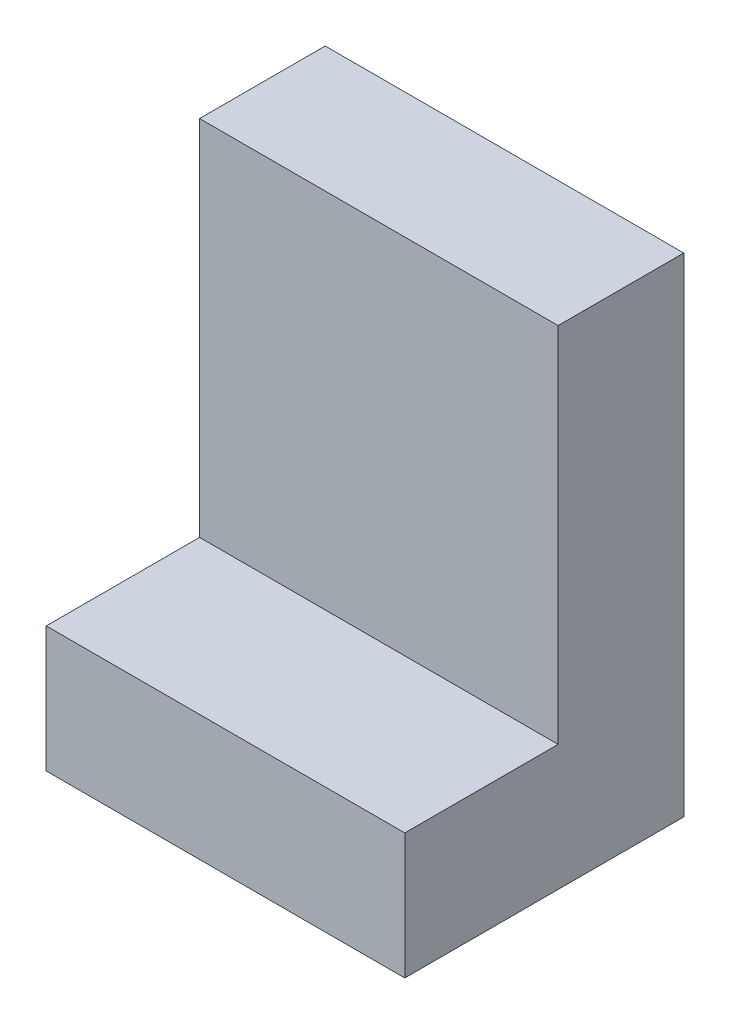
from build123d import *

# Parameters (mm, degrees)
BASE_EXTRUDE_DEPTH = 50


with BuildPart() as part:
    # Sketch1 → Base-Extrude (new body)
    with BuildSketch(Plane(origin=(0, 0, 0), x_dir=(0, 0, -1), z_dir=(1, 0, 0))):
        Polygon((0, 0), (38.907362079, 0), (38.907362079, 68.105285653), (21.384890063, 68.105285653), (21.384890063, 17.522472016), (0, 17.522472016), align=None)
    extrude(amount=BASE_EXTRUDE_DEPTH)


solid = part.part
